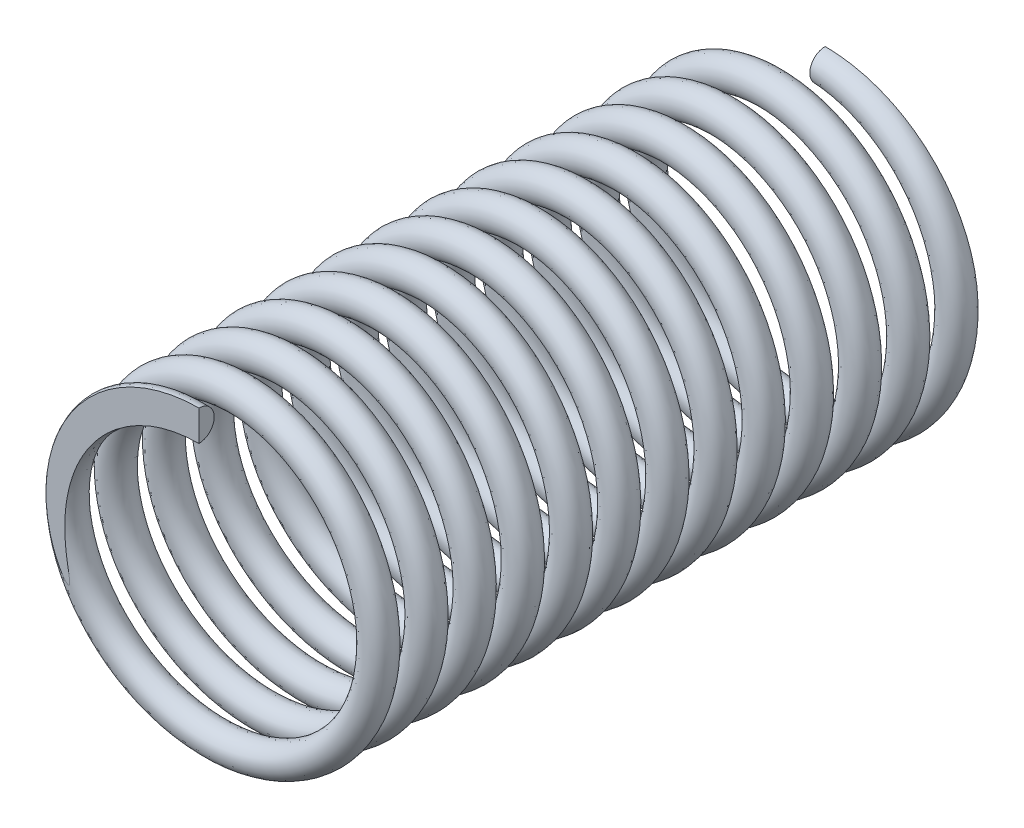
from build123d import *

# Parameters (mm, degrees)
BALAYAGE1_PITCH         = 1.884615
BALAYAGE1_HEIGHT        = 24.499995
BALAYAGE1_RADIUS        = 5.6
BALAYAGE1_START_ANGLE   = 90
ESQUISSE2_R             = 0.6
ESQUISSE3_W             = 15.314485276
ESQUISSE3_H             = 14.776408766
ENL_V_MAT_EXTRU_1_DEPTH = 10
ESQUISSE4_W             = 14.030373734
ESQUISSE4_H             = 13.898633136
ENL_V_MAT_EXTRU_2_DEPTH = 10


with BuildPart() as part:
    # Balayage1: sweep along a helix
    with BuildLine() as balayage1_path:
        add(Helix(BALAYAGE1_PITCH, BALAYAGE1_HEIGHT, BALAYAGE1_RADIUS, center=(0, 0, 0), direction=(0, 0, 1), lefthand=True, mode=Mode.PRIVATE).rotate(Axis((0, 0, 0), (0, 0, 1)), BALAYAGE1_START_ANGLE))
    # Esquisse2 → Balayage1 (sweep)
    with BuildSketch(Plane(origin=(0, 0, 0), x_dir=(0, 0, -1), z_dir=(1, 0, 0))):
        with Locations((0, 5.6)):
            Circle(ESQUISSE2_R)
    sweep(path=balayage1_path.line, is_frenet=True)

    # Esquisse3 → Enl_v. mat.-Extru.1 (cut)
    with BuildSketch(Plane.XY):
        with Locations((-0.229017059, -0.434600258)):
            Rectangle(ESQUISSE3_W, ESQUISSE3_H)
    extrude(amount=-ENL_V_MAT_EXTRU_1_DEPTH, mode=Mode.SUBTRACT)

    # Esquisse4 → Enl_v. mat.-Extru.2 (cut)
    with BuildSketch(Plane.XY.offset(24.5)):
        with Locations((0.03293515, 0.054891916)):
            Rectangle(ESQUISSE4_W, ESQUISSE4_H)
    extrude(amount=ENL_V_MAT_EXTRU_2_DEPTH, mode=Mode.SUBTRACT)


solid = part.part
